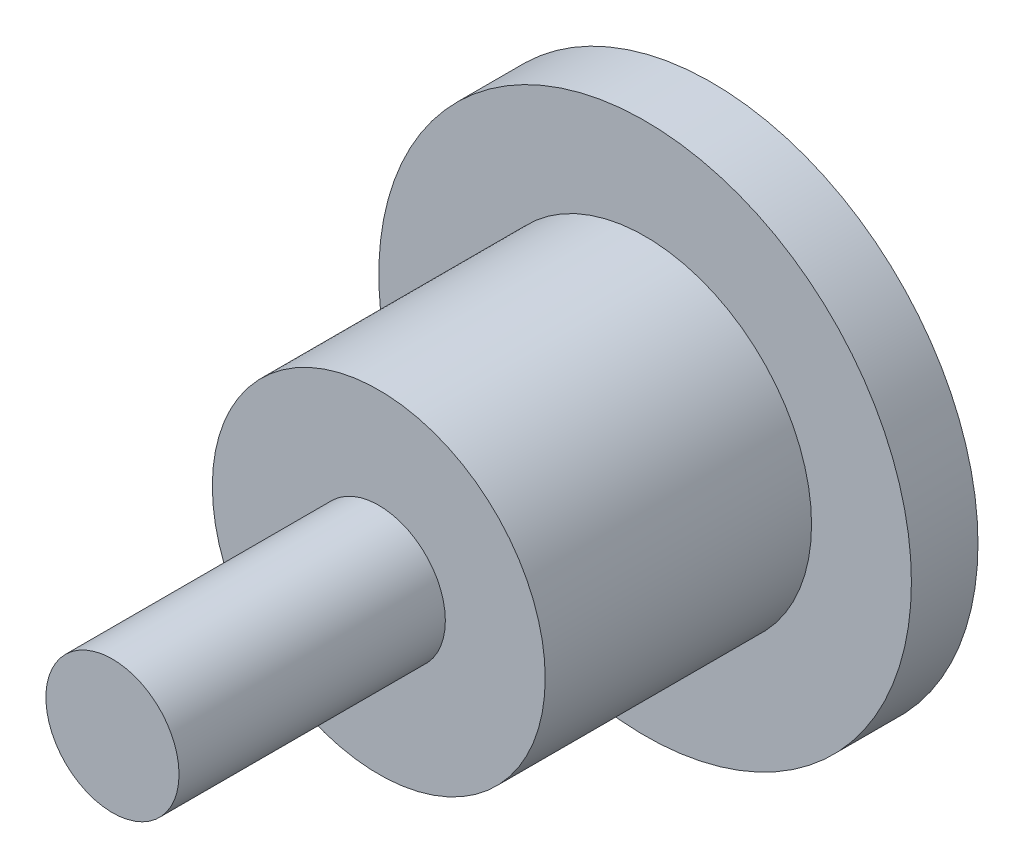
ISO-10303-21;
HEADER;
FILE_DESCRIPTION(('STEP AP214'),'2;1');
FILE_NAME('part.step','',(''),(''),'','','');
FILE_SCHEMA(('AUTOMOTIVE_DESIGN { 1 0 10303 214 1 1 1 1 }'));
ENDSEC;
DATA;
#1=APPLICATION_CONTEXT('core data for automotive mechanical design processes');
#2=APPLICATION_PROTOCOL_DEFINITION('international standard','automotive_design',2000,#1);
#3=PRODUCT_CONTEXT('',#1,'mechanical');
#4=PRODUCT('Part','Part','',(#3));
#5=PRODUCT_RELATED_PRODUCT_CATEGORY('part','',(#4));
#6=PRODUCT_DEFINITION_FORMATION('','',#4);
#7=PRODUCT_DEFINITION_CONTEXT('part definition',#1,'design');
#8=PRODUCT_DEFINITION('design','',#6,#7);
#9=PRODUCT_DEFINITION_SHAPE('','',#8);
#10=(LENGTH_UNIT() NAMED_UNIT(*) SI_UNIT(.MILLI.,.METRE.));
#11=(NAMED_UNIT(*) PLANE_ANGLE_UNIT() SI_UNIT($,.RADIAN.));
#12=(NAMED_UNIT(*) SI_UNIT($,.STERADIAN.) SOLID_ANGLE_UNIT());
#13=UNCERTAINTY_MEASURE_WITH_UNIT(LENGTH_MEASURE(1.E-05),#10,'distance_accuracy_value','');
#14=(GEOMETRIC_REPRESENTATION_CONTEXT(3) GLOBAL_UNCERTAINTY_ASSIGNED_CONTEXT((#13)) GLOBAL_UNIT_ASSIGNED_CONTEXT((#10,
#11,#12)) REPRESENTATION_CONTEXT('',''));
#15=CARTESIAN_POINT('',(0.,0.,0.));
#16=DIRECTION('',(0.,0.,1.));
#17=DIRECTION('',(1.,0.,0.));
#18=AXIS2_PLACEMENT_3D('',#15,#16,#17);
#19=CARTESIAN_POINT('',(0.,0.,0.5));
#20=DIRECTION('',(0.,0.,-1.));
#21=DIRECTION('',(-1.,0.,0.));
#22=AXIS2_PLACEMENT_3D('',#19,#20,#21);
#23=CYLINDRICAL_SURFACE('',#22,2.);
#24=CARTESIAN_POINT('',(0.,0.,0.5));
#25=DIRECTION('',(0.,0.,1.));
#26=DIRECTION('',(1.,0.,0.));
#27=AXIS2_PLACEMENT_3D('',#24,#25,#26);
#28=CIRCLE('',#27,2.);
#29=CARTESIAN_POINT('',(2.,0.,0.5));
#30=VERTEX_POINT('',#29);
#31=EDGE_CURVE('E44',#30,#30,#28,.T.);
#32=ORIENTED_EDGE('',*,*,#31,.F.);
#33=EDGE_LOOP('',(#32));
#34=FACE_BOUND('',#33,.T.);
#35=CARTESIAN_POINT('',(0.,0.,0.));
#36=DIRECTION('',(0.,0.,1.));
#37=DIRECTION('',(1.,0.,0.));
#38=AXIS2_PLACEMENT_3D('',#35,#36,#37);
#39=CIRCLE('',#38,2.);
#40=CARTESIAN_POINT('',(2.,0.,0.));
#41=VERTEX_POINT('',#40);
#42=EDGE_CURVE('E35',#41,#41,#39,.T.);
#43=ORIENTED_EDGE('',*,*,#42,.T.);
#44=EDGE_LOOP('',(#43));
#45=FACE_BOUND('',#44,.T.);
#46=ADVANCED_FACE('F32',(#34,#45),#23,.T.);
#47=CARTESIAN_POINT('',(0.,0.,0.5));
#48=DIRECTION('',(0.,0.,1.));
#49=DIRECTION('',(1.,0.,0.));
#50=AXIS2_PLACEMENT_3D('',#47,#48,#49);
#51=PLANE('',#50);
#52=CARTESIAN_POINT('',(0.,0.,0.5));
#53=DIRECTION('',(0.,0.,1.));
#54=DIRECTION('',(1.,0.,0.));
#55=AXIS2_PLACEMENT_3D('',#52,#53,#54);
#56=CIRCLE('',#55,1.25);
#57=CARTESIAN_POINT('',(1.25,0.,0.5));
#58=VERTEX_POINT('',#57);
#59=EDGE_CURVE('E39',#58,#58,#56,.T.);
#60=ORIENTED_EDGE('',*,*,#59,.F.);
#61=EDGE_LOOP('',(#60));
#62=FACE_BOUND('',#61,.T.);
#63=ORIENTED_EDGE('',*,*,#31,.T.);
#64=EDGE_LOOP('',(#63));
#65=FACE_BOUND('',#64,.T.);
#66=ADVANCED_FACE('F61',(#62,#65),#51,.T.);
#67=CARTESIAN_POINT('',(0.,0.,0.));
#68=DIRECTION('',(0.,0.,1.));
#69=DIRECTION('',(1.,0.,0.));
#70=AXIS2_PLACEMENT_3D('',#67,#68,#69);
#71=PLANE('',#70);
#72=ORIENTED_EDGE('',*,*,#42,.F.);
#73=EDGE_LOOP('',(#72));
#74=FACE_BOUND('',#73,.T.);
#75=ADVANCED_FACE('F58',(#74),#71,.F.);
#76=CARTESIAN_POINT('',(0.,0.,2.5));
#77=DIRECTION('',(0.,0.,-1.));
#78=DIRECTION('',(-1.,0.,0.));
#79=AXIS2_PLACEMENT_3D('',#76,#77,#78);
#80=CYLINDRICAL_SURFACE('',#79,1.25);
#81=CARTESIAN_POINT('',(0.,0.,2.5));
#82=DIRECTION('',(0.,0.,1.));
#83=DIRECTION('',(1.,0.,0.));
#84=AXIS2_PLACEMENT_3D('',#81,#82,#83);
#85=CIRCLE('',#84,1.25);
#86=CARTESIAN_POINT('',(1.25,0.,2.5));
#87=VERTEX_POINT('',#86);
#88=EDGE_CURVE('E49',#87,#87,#85,.T.);
#89=ORIENTED_EDGE('',*,*,#88,.F.);
#90=EDGE_LOOP('',(#89));
#91=FACE_BOUND('',#90,.T.);
#92=ORIENTED_EDGE('',*,*,#59,.T.);
#93=EDGE_LOOP('',(#92));
#94=FACE_BOUND('',#93,.T.);
#95=ADVANCED_FACE('F60',(#91,#94),#80,.T.);
#96=CARTESIAN_POINT('',(0.,0.,2.5));
#97=DIRECTION('',(0.,0.,1.));
#98=DIRECTION('',(1.,0.,0.));
#99=AXIS2_PLACEMENT_3D('',#96,#97,#98);
#100=PLANE('',#99);
#101=CARTESIAN_POINT('',(0.,0.,2.5));
#102=DIRECTION('',(0.,0.,1.));
#103=DIRECTION('',(1.,0.,0.));
#104=AXIS2_PLACEMENT_3D('',#101,#102,#103);
#105=CIRCLE('',#104,0.5);
#106=CARTESIAN_POINT('',(0.5,0.,2.5));
#107=VERTEX_POINT('',#106);
#108=EDGE_CURVE('E10',#107,#107,#105,.T.);
#109=ORIENTED_EDGE('',*,*,#108,.F.);
#110=EDGE_LOOP('',(#109));
#111=FACE_BOUND('',#110,.T.);
#112=ORIENTED_EDGE('',*,*,#88,.T.);
#113=EDGE_LOOP('',(#112));
#114=FACE_BOUND('',#113,.T.);
#115=ADVANCED_FACE('F66',(#111,#114),#100,.T.);
#116=CARTESIAN_POINT('',(0.,0.,4.5));
#117=DIRECTION('',(0.,0.,-1.));
#118=DIRECTION('',(-1.,0.,0.));
#119=AXIS2_PLACEMENT_3D('',#116,#117,#118);
#120=CYLINDRICAL_SURFACE('',#119,0.5);
#121=CARTESIAN_POINT('',(0.,0.,4.5));
#122=DIRECTION('',(0.,0.,1.));
#123=DIRECTION('',(1.,0.,0.));
#124=AXIS2_PLACEMENT_3D('',#121,#122,#123);
#125=CIRCLE('',#124,0.5);
#126=CARTESIAN_POINT('',(0.5,0.,4.5));
#127=VERTEX_POINT('',#126);
#128=EDGE_CURVE('E48',#127,#127,#125,.T.);
#129=ORIENTED_EDGE('',*,*,#128,.F.);
#130=EDGE_LOOP('',(#129));
#131=FACE_BOUND('',#130,.T.);
#132=ORIENTED_EDGE('',*,*,#108,.T.);
#133=EDGE_LOOP('',(#132));
#134=FACE_BOUND('',#133,.T.);
#135=ADVANCED_FACE('F96',(#131,#134),#120,.T.);
#136=CARTESIAN_POINT('',(0.,0.,4.5));
#137=DIRECTION('',(0.,0.,1.));
#138=DIRECTION('',(1.,0.,0.));
#139=AXIS2_PLACEMENT_3D('',#136,#137,#138);
#140=PLANE('',#139);
#141=ORIENTED_EDGE('',*,*,#128,.T.);
#142=EDGE_LOOP('',(#141));
#143=FACE_BOUND('',#142,.T.);
#144=ADVANCED_FACE('F106',(#143),#140,.T.);
#145=CLOSED_SHELL('',(#46,#66,#75,#95,#115,#135,#144));
#146=MANIFOLD_SOLID_BREP('B2',#145);
#147=ADVANCED_BREP_SHAPE_REPRESENTATION('',(#18,#146),#14);
#148=SHAPE_DEFINITION_REPRESENTATION(#9,#147);
ENDSEC;
END-ISO-10303-21;
